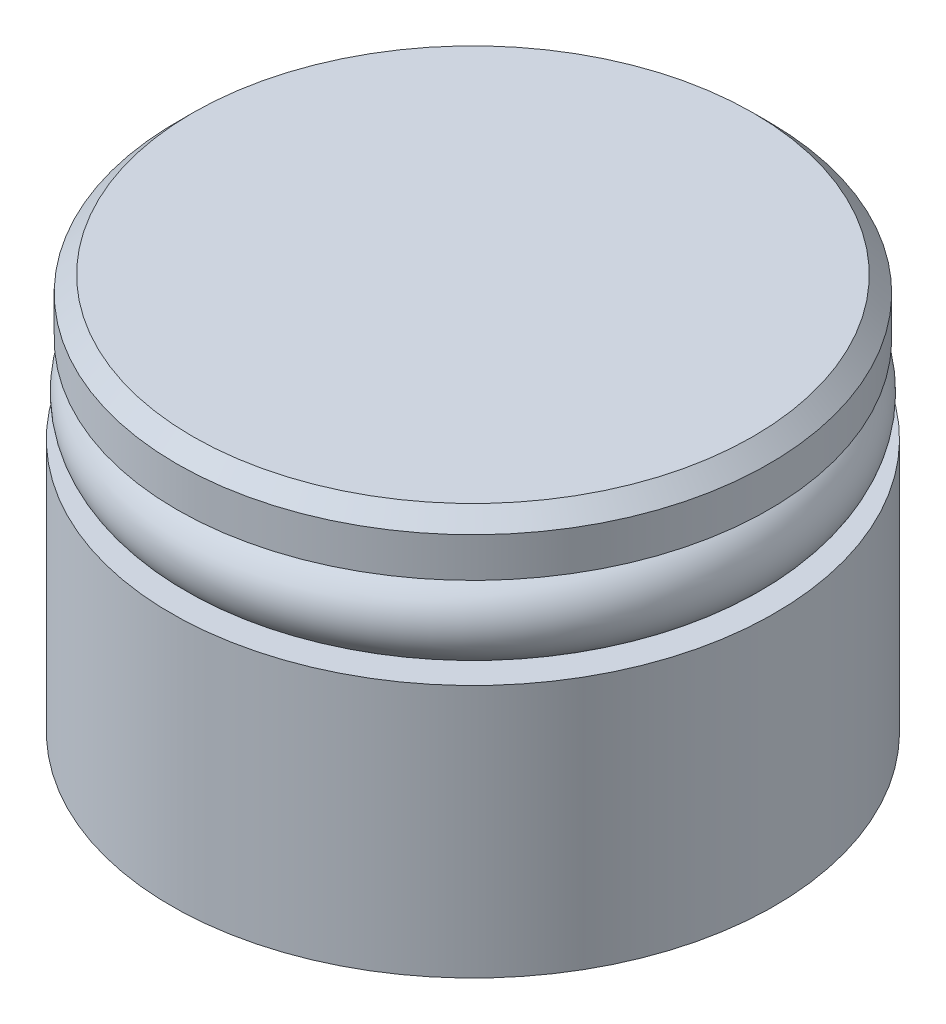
ISO-10303-21;
HEADER;
FILE_DESCRIPTION(('STEP AP214'),'2;1');
FILE_NAME('part.step','',(''),(''),'','','');
FILE_SCHEMA(('AUTOMOTIVE_DESIGN { 1 0 10303 214 1 1 1 1 }'));
ENDSEC;
DATA;
#1=APPLICATION_CONTEXT('core data for automotive mechanical design processes');
#2=APPLICATION_PROTOCOL_DEFINITION('international standard','automotive_design',2000,#1);
#3=PRODUCT_CONTEXT('',#1,'mechanical');
#4=PRODUCT('Part','Part','',(#3));
#5=PRODUCT_RELATED_PRODUCT_CATEGORY('part','',(#4));
#6=PRODUCT_DEFINITION_FORMATION('','',#4);
#7=PRODUCT_DEFINITION_CONTEXT('part definition',#1,'design');
#8=PRODUCT_DEFINITION('design','',#6,#7);
#9=PRODUCT_DEFINITION_SHAPE('','',#8);
#10=(LENGTH_UNIT() NAMED_UNIT(*) SI_UNIT(.MILLI.,.METRE.));
#11=(NAMED_UNIT(*) PLANE_ANGLE_UNIT() SI_UNIT($,.RADIAN.));
#12=(NAMED_UNIT(*) SI_UNIT($,.STERADIAN.) SOLID_ANGLE_UNIT());
#13=UNCERTAINTY_MEASURE_WITH_UNIT(LENGTH_MEASURE(1.E-05),#10,'distance_accuracy_value','');
#14=(GEOMETRIC_REPRESENTATION_CONTEXT(3) GLOBAL_UNCERTAINTY_ASSIGNED_CONTEXT((#13)) GLOBAL_UNIT_ASSIGNED_CONTEXT((#10,
#11,#12)) REPRESENTATION_CONTEXT('',''));
#15=CARTESIAN_POINT('',(0.,0.,0.));
#16=DIRECTION('',(0.,0.,1.));
#17=DIRECTION('',(1.,0.,0.));
#18=AXIS2_PLACEMENT_3D('',#15,#16,#17);
#19=CARTESIAN_POINT('',(0.,9.4361,0.));
#20=DIRECTION('',(0.,-1.,0.));
#21=DIRECTION('',(0.,0.,-1.));
#22=AXIS2_PLACEMENT_3D('',#19,#20,#21);
#23=TOROIDAL_SURFACE('',#22,8.2804,1.3081);
#24=CARTESIAN_POINT('',(0.,9.4361,-9.5885));
#25=VERTEX_POINT('',#24);
#26=VERTEX_LOOP('',#25);
#27=FACE_BOUND('',#26,.T.);
#28=ADVANCED_FACE('P0_F12',(#27),#23,.T.);
#29=CLOSED_SHELL('',(#28));
#30=MANIFOLD_SOLID_BREP('P0_B1',#29);
#31=CARTESIAN_POINT('',(0.,0.,0.));
#32=DIRECTION('',(0.,-1.,0.));
#33=DIRECTION('',(0.,0.,-1.));
#34=AXIS2_PLACEMENT_3D('',#31,#32,#33);
#35=PLANE('',#34);
#36=CARTESIAN_POINT('',(0.,0.,0.));
#37=DIRECTION('',(0.,-1.,0.));
#38=DIRECTION('',(0.,0.,-1.));
#39=AXIS2_PLACEMENT_3D('',#36,#37,#38);
#40=CIRCLE('',#39,3.2639);
#41=CARTESIAN_POINT('',(0.,0.,-3.2639));
#42=VERTEX_POINT('',#41);
#43=EDGE_CURVE('P1_E36',#42,#42,#40,.T.);
#44=ORIENTED_EDGE('',*,*,#43,.F.);
#45=EDGE_LOOP('',(#44));
#46=FACE_BOUND('',#45,.T.);
#47=CARTESIAN_POINT('',(0.,0.,0.));
#48=DIRECTION('',(0.,-1.,0.));
#49=DIRECTION('',(0.,0.,-1.));
#50=AXIS2_PLACEMENT_3D('',#47,#48,#49);
#51=CIRCLE('',#50,9.6774);
#52=CARTESIAN_POINT('',(0.,0.,-9.6774));
#53=VERTEX_POINT('',#52);
#54=EDGE_CURVE('P1_E52',#53,#53,#51,.T.);
#55=ORIENTED_EDGE('',*,*,#54,.T.);
#56=EDGE_LOOP('',(#55));
#57=FACE_BOUND('',#56,.T.);
#58=ADVANCED_FACE('P1_F15',(#46,#57),#35,.T.);
#59=CARTESIAN_POINT('',(0.,0.,0.));
#60=DIRECTION('',(0.,-1.,0.));
#61=DIRECTION('',(0.,0.,-1.));
#62=AXIS2_PLACEMENT_3D('',#59,#60,#61);
#63=CYLINDRICAL_SURFACE('',#62,9.6774);
#64=CARTESIAN_POINT('',(0.,8.128,0.));
#65=DIRECTION('',(0.,-1.,0.));
#66=DIRECTION('',(0.,0.,-1.));
#67=AXIS2_PLACEMENT_3D('',#64,#65,#66);
#68=CIRCLE('',#67,9.6774);
#69=CARTESIAN_POINT('',(0.,8.128,-9.6774));
#70=VERTEX_POINT('',#69);
#71=EDGE_CURVE('P1_E49',#70,#70,#68,.T.);
#72=ORIENTED_EDGE('',*,*,#71,.T.);
#73=EDGE_LOOP('',(#72));
#74=FACE_BOUND('',#73,.T.);
#75=ORIENTED_EDGE('',*,*,#54,.F.);
#76=EDGE_LOOP('',(#75));
#77=FACE_BOUND('',#76,.T.);
#78=ADVANCED_FACE('P1_F69',(#74,#77),#63,.T.);
#79=CARTESIAN_POINT('',(9.6774,8.128,0.));
#80=DIRECTION('',(0.,1.,0.));
#81=DIRECTION('',(0.,0.,1.));
#82=AXIS2_PLACEMENT_3D('',#79,#80,#81);
#83=PLANE('',#82);
#84=CARTESIAN_POINT('',(0.,8.128,0.));
#85=DIRECTION('',(0.,-1.,0.));
#86=DIRECTION('',(0.,0.,-1.));
#87=AXIS2_PLACEMENT_3D('',#84,#85,#86);
#88=CIRCLE('',#87,8.12165);
#89=CARTESIAN_POINT('',(0.,8.128,-8.12165));
#90=VERTEX_POINT('',#89);
#91=EDGE_CURVE('P1_E46',#90,#90,#88,.T.);
#92=ORIENTED_EDGE('',*,*,#91,.T.);
#93=EDGE_LOOP('',(#92));
#94=FACE_BOUND('',#93,.T.);
#95=ORIENTED_EDGE('',*,*,#71,.F.);
#96=EDGE_LOOP('',(#95));
#97=FACE_BOUND('',#96,.T.);
#98=ADVANCED_FACE('P1_F74',(#94,#97),#83,.T.);
#99=CARTESIAN_POINT('',(0.,0.,0.));
#100=DIRECTION('',(0.,-1.,0.));
#101=DIRECTION('',(0.,0.,-1.));
#102=AXIS2_PLACEMENT_3D('',#99,#100,#101);
#103=CYLINDRICAL_SURFACE('',#102,8.12165);
#104=CARTESIAN_POINT('',(0.,10.922,0.));
#105=DIRECTION('',(0.,-1.,0.));
#106=DIRECTION('',(0.,0.,-1.));
#107=AXIS2_PLACEMENT_3D('',#104,#105,#106);
#108=CIRCLE('',#107,8.12165);
#109=CARTESIAN_POINT('',(0.,10.922,-8.12165));
#110=VERTEX_POINT('',#109);
#111=EDGE_CURVE('P1_E39',#110,#110,#108,.T.);
#112=ORIENTED_EDGE('',*,*,#111,.T.);
#113=EDGE_LOOP('',(#112));
#114=FACE_BOUND('',#113,.T.);
#115=ORIENTED_EDGE('',*,*,#91,.F.);
#116=EDGE_LOOP('',(#115));
#117=FACE_BOUND('',#116,.T.);
#118=ADVANCED_FACE('P1_F82',(#114,#117),#103,.T.);
#119=CARTESIAN_POINT('',(8.12165,10.922,0.));
#120=DIRECTION('',(0.,-1.,0.));
#121=DIRECTION('',(0.,0.,-1.));
#122=AXIS2_PLACEMENT_3D('',#119,#120,#121);
#123=PLANE('',#122);
#124=CARTESIAN_POINT('',(0.,10.922,0.));
#125=DIRECTION('',(0.,-1.,0.));
#126=DIRECTION('',(0.,0.,-1.));
#127=AXIS2_PLACEMENT_3D('',#124,#125,#126);
#128=CIRCLE('',#127,9.4996);
#129=CARTESIAN_POINT('',(0.,10.922,-9.4996));
#130=VERTEX_POINT('',#129);
#131=EDGE_CURVE('P1_E35',#130,#130,#128,.T.);
#132=ORIENTED_EDGE('',*,*,#131,.T.);
#133=EDGE_LOOP('',(#132));
#134=FACE_BOUND('',#133,.T.);
#135=ORIENTED_EDGE('',*,*,#111,.F.);
#136=EDGE_LOOP('',(#135));
#137=FACE_BOUND('',#136,.T.);
#138=ADVANCED_FACE('P1_F86',(#134,#137),#123,.T.);
#139=CARTESIAN_POINT('',(0.,0.,0.));
#140=DIRECTION('',(0.,-1.,0.));
#141=DIRECTION('',(0.,0.,-1.));
#142=AXIS2_PLACEMENT_3D('',#139,#140,#141);
#143=CYLINDRICAL_SURFACE('',#142,9.4996);
#144=CARTESIAN_POINT('',(0.,12.192,0.));
#145=DIRECTION('',(0.,1.,0.));
#146=DIRECTION('',(0.,0.,1.));
#147=AXIS2_PLACEMENT_3D('',#144,#145,#146);
#148=CIRCLE('',#147,9.4996);
#149=CARTESIAN_POINT('',(0.,12.192,9.4996));
#150=VERTEX_POINT('',#149);
#151=EDGE_CURVE('P1_E22',#150,#150,#148,.F.);
#152=ORIENTED_EDGE('',*,*,#151,.T.);
#153=EDGE_LOOP('',(#152));
#154=FACE_BOUND('',#153,.T.);
#155=ORIENTED_EDGE('',*,*,#131,.F.);
#156=EDGE_LOOP('',(#155));
#157=FACE_BOUND('',#156,.T.);
#158=ADVANCED_FACE('P1_F57',(#154,#157),#143,.T.);
#159=CARTESIAN_POINT('',(9.4996,12.7,0.));
#160=DIRECTION('',(0.,1.,0.));
#161=DIRECTION('',(0.,0.,1.));
#162=AXIS2_PLACEMENT_3D('',#159,#160,#161);
#163=PLANE('',#162);
#164=CARTESIAN_POINT('',(0.,12.7,0.));
#165=DIRECTION('',(0.,1.,0.));
#166=DIRECTION('',(0.,0.,1.));
#167=AXIS2_PLACEMENT_3D('',#164,#165,#166);
#168=CIRCLE('',#167,8.99160000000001);
#169=CARTESIAN_POINT('',(0.,12.7,8.99160000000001));
#170=VERTEX_POINT('',#169);
#171=EDGE_CURVE('P1_E10',#170,#170,#168,.T.);
#172=ORIENTED_EDGE('',*,*,#171,.T.);
#173=EDGE_LOOP('',(#172));
#174=FACE_BOUND('',#173,.T.);
#175=ADVANCED_FACE('P1_F29',(#174),#163,.T.);
#176=CARTESIAN_POINT('',(0.,6.35,0.));
#177=DIRECTION('',(0.,-1.,0.));
#178=DIRECTION('',(0.,0.,-1.));
#179=AXIS2_PLACEMENT_3D('',#176,#177,#178);
#180=CONICAL_SURFACE('',#179,3.2639,1.02974425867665);
#181=CARTESIAN_POINT('',(0.,8.31114897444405,0.));
#182=VERTEX_POINT('',#181);
#183=VERTEX_LOOP('',#182);
#184=FACE_BOUND('',#183,.T.);
#185=CARTESIAN_POINT('',(0.,6.35,0.));
#186=DIRECTION('',(0.,-1.,0.));
#187=DIRECTION('',(0.,0.,-1.));
#188=AXIS2_PLACEMENT_3D('',#185,#186,#187);
#189=CIRCLE('',#188,3.2639);
#190=CARTESIAN_POINT('',(0.,6.35,-3.2639));
#191=VERTEX_POINT('',#190);
#192=EDGE_CURVE('P1_E33',#191,#191,#189,.T.);
#193=ORIENTED_EDGE('',*,*,#192,.T.);
#194=EDGE_LOOP('',(#193));
#195=FACE_BOUND('',#194,.T.);
#196=ADVANCED_FACE('P1_F25',(#184,#195),#180,.F.);
#197=CARTESIAN_POINT('',(0.,0.,0.));
#198=DIRECTION('',(0.,-1.,0.));
#199=DIRECTION('',(0.,0.,-1.));
#200=AXIS2_PLACEMENT_3D('',#197,#198,#199);
#201=CYLINDRICAL_SURFACE('',#200,3.2639);
#202=ORIENTED_EDGE('',*,*,#192,.F.);
#203=EDGE_LOOP('',(#202));
#204=FACE_BOUND('',#203,.T.);
#205=ORIENTED_EDGE('',*,*,#43,.T.);
#206=EDGE_LOOP('',(#205));
#207=FACE_BOUND('',#206,.T.);
#208=ADVANCED_FACE('P1_F28',(#204,#207),#201,.F.);
#209=CARTESIAN_POINT('',(0.,12.192,0.));
#210=DIRECTION('',(0.,-1.,0.));
#211=DIRECTION('',(0.,0.,-1.));
#212=AXIS2_PLACEMENT_3D('',#209,#210,#211);
#213=CONICAL_SURFACE('',#212,9.4996,0.785398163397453);
#214=ORIENTED_EDGE('',*,*,#171,.F.);
#215=EDGE_LOOP('',(#214));
#216=FACE_BOUND('',#215,.T.);
#217=ORIENTED_EDGE('',*,*,#151,.F.);
#218=EDGE_LOOP('',(#217));
#219=FACE_BOUND('',#218,.T.);
#220=ADVANCED_FACE('P1_F17',(#216,#219),#213,.T.);
#221=CLOSED_SHELL('',(#58,#78,#98,#118,#138,#158,#175,#196,#208,#220));
#222=MANIFOLD_SOLID_BREP('P1_B1',#221);
#223=ADVANCED_BREP_SHAPE_REPRESENTATION('',(#18,#30,#222),#14);
#224=SHAPE_DEFINITION_REPRESENTATION(#9,#223);
ENDSEC;
END-ISO-10303-21;
